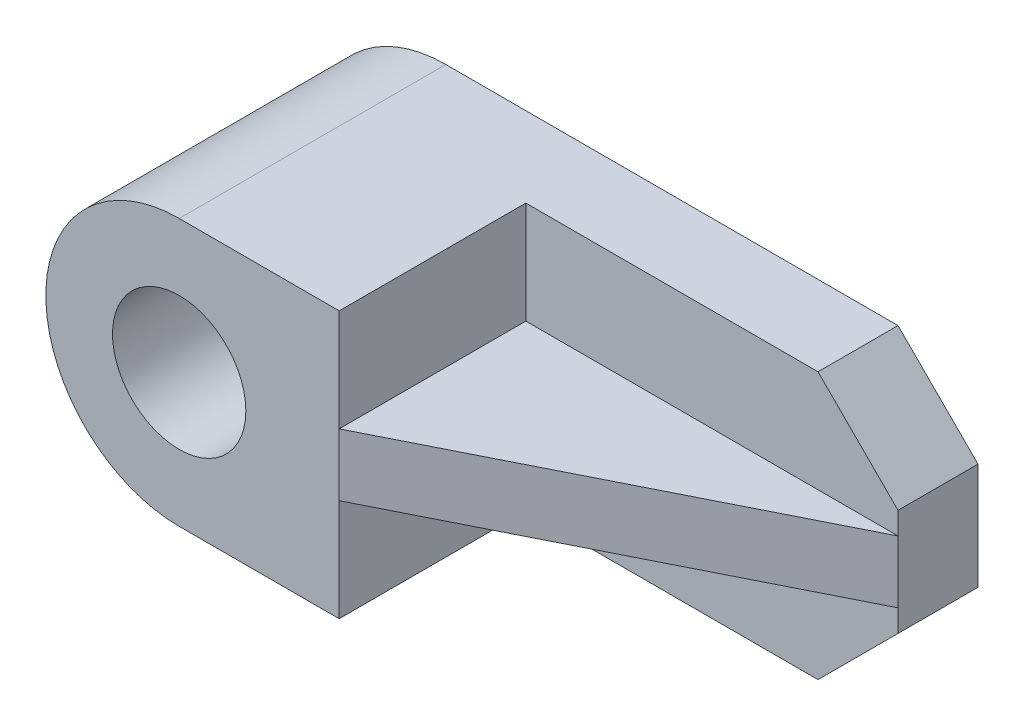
from build123d import *

# Parameters (mm, degrees)
SALIENTE_EXTRUIR2_DEPTH = 15
CROQUIS2_W              = 41.872545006
CROQUIS2_H              = 21
CORTAR_EXTRUIR1_DEPTH   = 59.933715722
CROQUIS3_R              = 7.5
CORTAR_EXTRUIR2_DEPTH   = 59.933715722
SALIENTE_EXTRUIR3_DEPTH = 3.5


with BuildPart() as part:
    # Croquis1 → Saliente-Extruir2 (new, symmetric)
    with BuildSketch(Plane.XY):
        with BuildLine():
            Line((-33.458052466, 15), (17.41449254, 15))
            Line((17.41449254, 15), (26.41449254, 6))
            Line((26.41449254, 6), (26.41449254, -6))
            Line((26.41449254, -6), (17.41449254, -15))
            Line((17.41449254, -15), (-33.458052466, -15))
            ThreePointArc((-33.458052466, -15), (-48.458052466, 0), (-33.458052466, 15))
        make_face()
    extrude(amount=SALIENTE_EXTRUIR2_DEPTH, both=True)

    # Croquis2 → Cortar-Extruir1 (cut, through all)
    with BuildSketch(Plane.XZ.offset(15)):
        with Locations((5.478220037, 4.5)):
            Rectangle(CROQUIS2_W, CROQUIS2_H)
    extrude(amount=-CORTAR_EXTRUIR1_DEPTH, mode=Mode.SUBTRACT)

    # Croquis3 → Cortar-Extruir2 (cut, through all)
    with BuildSketch(Plane.XY.offset(15)):
        with Locations((-33.458052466, 0)):
            Circle(CROQUIS3_R)
    extrude(amount=-CORTAR_EXTRUIR2_DEPTH, mode=Mode.SUBTRACT)

    # Croquis4 → Saliente-Extruir3 (add, symmetric)
    with BuildSketch(Plane(origin=(0, 0, 0), x_dir=(1, 0, 0), z_dir=(0, 1, 0))):
        Polygon((-15.458052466, -15), (26.41449254, 6), (-15.458052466, 6), align=None)
    extrude(amount=SALIENTE_EXTRUIR3_DEPTH, both=True)


solid = part.part
